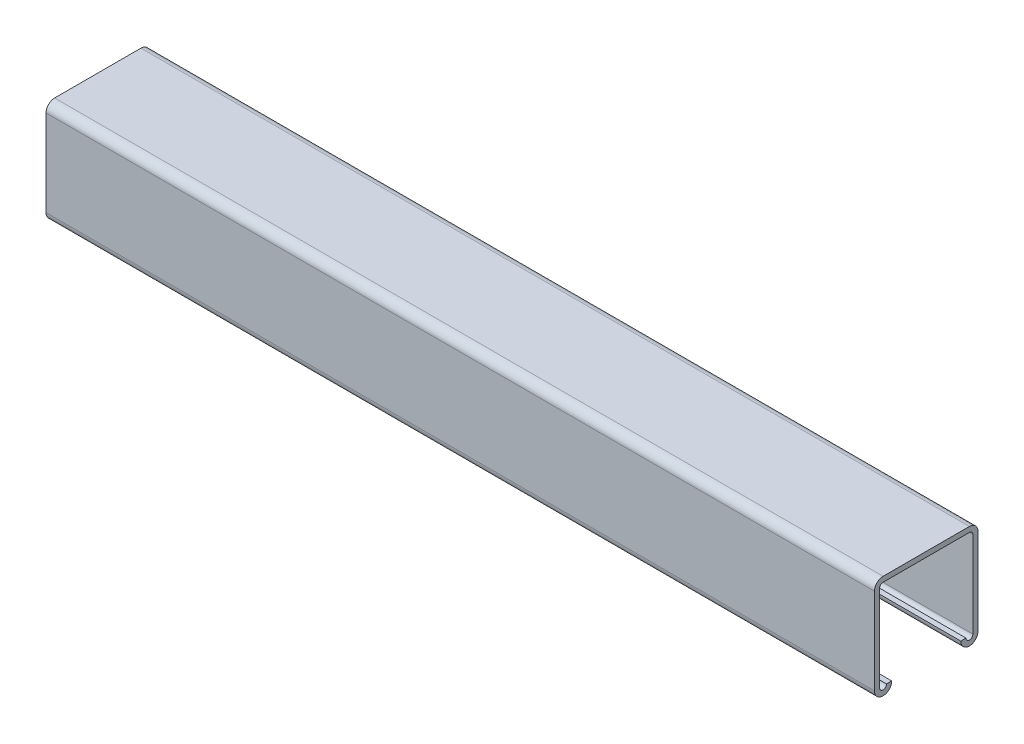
ISO-10303-21;
HEADER;
FILE_DESCRIPTION(('STEP AP214'),'2;1');
FILE_NAME('part.step','',(''),(''),'','','');
FILE_SCHEMA(('AUTOMOTIVE_DESIGN { 1 0 10303 214 1 1 1 1 }'));
ENDSEC;
DATA;
#1=APPLICATION_CONTEXT('core data for automotive mechanical design processes');
#2=APPLICATION_PROTOCOL_DEFINITION('international standard','automotive_design',2000,#1);
#3=PRODUCT_CONTEXT('',#1,'mechanical');
#4=PRODUCT('Part','Part','',(#3));
#5=PRODUCT_RELATED_PRODUCT_CATEGORY('part','',(#4));
#6=PRODUCT_DEFINITION_FORMATION('','',#4);
#7=PRODUCT_DEFINITION_CONTEXT('part definition',#1,'design');
#8=PRODUCT_DEFINITION('design','',#6,#7);
#9=PRODUCT_DEFINITION_SHAPE('','',#8);
#10=(LENGTH_UNIT() NAMED_UNIT(*) SI_UNIT(.MILLI.,.METRE.));
#11=(NAMED_UNIT(*) PLANE_ANGLE_UNIT() SI_UNIT($,.RADIAN.));
#12=(NAMED_UNIT(*) SI_UNIT($,.STERADIAN.) SOLID_ANGLE_UNIT());
#13=UNCERTAINTY_MEASURE_WITH_UNIT(LENGTH_MEASURE(1.E-05),#10,'distance_accuracy_value','');
#14=(GEOMETRIC_REPRESENTATION_CONTEXT(3) GLOBAL_UNCERTAINTY_ASSIGNED_CONTEXT((#13)) GLOBAL_UNIT_ASSIGNED_CONTEXT((#10,
#11,#12)) REPRESENTATION_CONTEXT('',''));
#15=CARTESIAN_POINT('',(0.,0.,0.));
#16=DIRECTION('',(0.,0.,1.));
#17=DIRECTION('',(1.,0.,0.));
#18=AXIS2_PLACEMENT_3D('',#15,#16,#17);
#19=CARTESIAN_POINT('',(304.8,-34.925,-15.875));
#20=DIRECTION('',(-1.,0.,0.));
#21=DIRECTION('',(0.,0.,1.));
#22=AXIS2_PLACEMENT_3D('',#19,#20,#21);
#23=CYLINDRICAL_SURFACE('',#22,1.27);
#24=CARTESIAN_POINT('',(0.,-34.925,-15.875));
#25=DIRECTION('',(1.,0.,0.));
#26=DIRECTION('',(0.,0.,1.));
#27=AXIS2_PLACEMENT_3D('',#24,#25,#26);
#28=CIRCLE('',#27,1.27);
#29=CARTESIAN_POINT('',(0.,-34.925,-17.145));
#30=VERTEX_POINT('',#29);
#31=CARTESIAN_POINT('',(0.,-34.925,-14.605));
#32=VERTEX_POINT('',#31);
#33=EDGE_CURVE('E151',#30,#32,#28,.F.);
#34=ORIENTED_EDGE('',*,*,#33,.T.);
#35=DIRECTION('',(-1.,0.,0.));
#36=VECTOR('',#35,1.);
#37=CARTESIAN_POINT('',(304.8,-34.925,-14.605));
#38=LINE('',#37,#36);
#39=CARTESIAN_POINT('',(304.8,-34.925,-14.605));
#40=VERTEX_POINT('',#39);
#41=EDGE_CURVE('E11',#40,#32,#38,.T.);
#42=ORIENTED_EDGE('',*,*,#41,.F.);
#43=CARTESIAN_POINT('',(304.8,-34.925,-15.875));
#44=DIRECTION('',(1.,0.,0.));
#45=DIRECTION('',(0.,0.,1.));
#46=AXIS2_PLACEMENT_3D('',#43,#44,#45);
#47=CIRCLE('',#46,1.27);
#48=CARTESIAN_POINT('',(304.8,-34.925,-17.145));
#49=VERTEX_POINT('',#48);
#50=EDGE_CURVE('E195',#49,#40,#47,.F.);
#51=ORIENTED_EDGE('',*,*,#50,.F.);
#52=DIRECTION('',(-1.,0.,0.));
#53=VECTOR('',#52,1.);
#54=CARTESIAN_POINT('',(304.8,-34.925,-17.145));
#55=LINE('',#54,#53);
#56=EDGE_CURVE('E152',#49,#30,#55,.T.);
#57=ORIENTED_EDGE('',*,*,#56,.T.);
#58=EDGE_LOOP('',(#34,#42,#51,#57));
#59=FACE_BOUND('',#58,.T.);
#60=ADVANCED_FACE('F29',(#59),#23,.F.);
#61=CARTESIAN_POINT('',(304.8,-34.925,-12.7));
#62=DIRECTION('',(0.,1.,0.));
#63=DIRECTION('',(0.,0.,1.));
#64=AXIS2_PLACEMENT_3D('',#61,#62,#63);
#65=PLANE('',#64);
#66=DIRECTION('',(0.,0.,-1.));
#67=VECTOR('',#66,1.);
#68=CARTESIAN_POINT('',(0.,-34.925,-12.7));
#69=LINE('',#68,#67);
#70=CARTESIAN_POINT('',(0.,-34.925,-12.7));
#71=VERTEX_POINT('',#70);
#72=EDGE_CURVE('E143',#71,#32,#69,.T.);
#73=ORIENTED_EDGE('',*,*,#72,.F.);
#74=DIRECTION('',(-1.,0.,0.));
#75=VECTOR('',#74,1.);
#76=CARTESIAN_POINT('',(304.8,-34.925,-12.7));
#77=LINE('',#76,#75);
#78=CARTESIAN_POINT('',(304.8,-34.925,-12.7));
#79=VERTEX_POINT('',#78);
#80=EDGE_CURVE('E36',#79,#71,#77,.T.);
#81=ORIENTED_EDGE('',*,*,#80,.F.);
#82=DIRECTION('',(0.,0.,-1.));
#83=VECTOR('',#82,1.);
#84=CARTESIAN_POINT('',(304.8,-34.925,-12.7));
#85=LINE('',#84,#83);
#86=EDGE_CURVE('E146',#79,#40,#85,.T.);
#87=ORIENTED_EDGE('',*,*,#86,.T.);
#88=ORIENTED_EDGE('',*,*,#41,.T.);
#89=EDGE_LOOP('',(#73,#81,#87,#88));
#90=FACE_BOUND('',#89,.T.);
#91=ADVANCED_FACE('F141',(#90),#65,.T.);
#92=CARTESIAN_POINT('',(304.8,-34.925,-15.875));
#93=DIRECTION('',(-1.,0.,0.));
#94=DIRECTION('',(0.,0.,1.));
#95=AXIS2_PLACEMENT_3D('',#92,#93,#94);
#96=CYLINDRICAL_SURFACE('',#95,3.175);
#97=CARTESIAN_POINT('',(0.,-34.925,-15.875));
#98=DIRECTION('',(-1.,0.,0.));
#99=DIRECTION('',(0.,0.,1.));
#100=AXIS2_PLACEMENT_3D('',#97,#98,#99);
#101=CIRCLE('',#100,3.175);
#102=CARTESIAN_POINT('',(0.,-34.925,-19.05));
#103=VERTEX_POINT('',#102);
#104=EDGE_CURVE('E159',#103,#71,#101,.T.);
#105=ORIENTED_EDGE('',*,*,#104,.F.);
#106=DIRECTION('',(-1.,0.,0.));
#107=VECTOR('',#106,1.);
#108=CARTESIAN_POINT('',(304.8,-34.925,-19.05));
#109=LINE('',#108,#107);
#110=CARTESIAN_POINT('',(304.8,-34.925,-19.05));
#111=VERTEX_POINT('',#110);
#112=EDGE_CURVE('E262',#111,#103,#109,.T.);
#113=ORIENTED_EDGE('',*,*,#112,.F.);
#114=CARTESIAN_POINT('',(304.8,-34.925,-15.875));
#115=DIRECTION('',(-1.,0.,0.));
#116=DIRECTION('',(0.,0.,1.));
#117=AXIS2_PLACEMENT_3D('',#114,#115,#116);
#118=CIRCLE('',#117,3.175);
#119=EDGE_CURVE('E198',#111,#79,#118,.T.);
#120=ORIENTED_EDGE('',*,*,#119,.T.);
#121=ORIENTED_EDGE('',*,*,#80,.T.);
#122=EDGE_LOOP('',(#105,#113,#120,#121));
#123=FACE_BOUND('',#122,.T.);
#124=ADVANCED_FACE('F264',(#123),#96,.T.);
#125=CARTESIAN_POINT('',(304.8,-3.175,-19.05));
#126=DIRECTION('',(0.,0.,-1.));
#127=DIRECTION('',(0.,1.,0.));
#128=AXIS2_PLACEMENT_3D('',#125,#126,#127);
#129=PLANE('',#128);
#130=DIRECTION('',(0.,-1.,0.));
#131=VECTOR('',#130,1.);
#132=CARTESIAN_POINT('',(0.,-3.175,-19.05));
#133=LINE('',#132,#131);
#134=CARTESIAN_POINT('',(0.,-3.175,-19.05));
#135=VERTEX_POINT('',#134);
#136=EDGE_CURVE('E161',#135,#103,#133,.T.);
#137=ORIENTED_EDGE('',*,*,#136,.F.);
#138=DIRECTION('',(-1.,0.,0.));
#139=VECTOR('',#138,1.);
#140=CARTESIAN_POINT('',(304.8,-3.175,-19.05));
#141=LINE('',#140,#139);
#142=CARTESIAN_POINT('',(304.8,-3.175,-19.05));
#143=VERTEX_POINT('',#142);
#144=EDGE_CURVE('E260',#143,#135,#141,.T.);
#145=ORIENTED_EDGE('',*,*,#144,.F.);
#146=DIRECTION('',(0.,-1.,0.));
#147=VECTOR('',#146,1.);
#148=CARTESIAN_POINT('',(304.8,-3.175,-19.05));
#149=LINE('',#148,#147);
#150=EDGE_CURVE('E201',#143,#111,#149,.T.);
#151=ORIENTED_EDGE('',*,*,#150,.T.);
#152=ORIENTED_EDGE('',*,*,#112,.T.);
#153=EDGE_LOOP('',(#137,#145,#151,#152));
#154=FACE_BOUND('',#153,.T.);
#155=ADVANCED_FACE('F271',(#154),#129,.T.);
#156=CARTESIAN_POINT('',(304.8,-3.175,-15.875));
#157=DIRECTION('',(-1.,0.,0.));
#158=DIRECTION('',(0.,0.,1.));
#159=AXIS2_PLACEMENT_3D('',#156,#157,#158);
#160=CYLINDRICAL_SURFACE('',#159,3.17499999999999);
#161=CARTESIAN_POINT('',(0.,-3.175,-15.875));
#162=DIRECTION('',(-1.,0.,0.));
#163=DIRECTION('',(0.,0.,1.));
#164=AXIS2_PLACEMENT_3D('',#161,#162,#163);
#165=CIRCLE('',#164,3.17499999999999);
#166=CARTESIAN_POINT('',(0.,0.,-15.875));
#167=VERTEX_POINT('',#166);
#168=EDGE_CURVE('E165',#167,#135,#165,.T.);
#169=ORIENTED_EDGE('',*,*,#168,.F.);
#170=DIRECTION('',(-1.,0.,0.));
#171=VECTOR('',#170,1.);
#172=CARTESIAN_POINT('',(304.8,0.,-15.875));
#173=LINE('',#172,#171);
#174=CARTESIAN_POINT('',(304.8,0.,-15.875));
#175=VERTEX_POINT('',#174);
#176=EDGE_CURVE('E258',#175,#167,#173,.T.);
#177=ORIENTED_EDGE('',*,*,#176,.F.);
#178=CARTESIAN_POINT('',(304.8,-3.175,-15.875));
#179=DIRECTION('',(-1.,0.,0.));
#180=DIRECTION('',(0.,0.,1.));
#181=AXIS2_PLACEMENT_3D('',#178,#179,#180);
#182=CIRCLE('',#181,3.17499999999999);
#183=EDGE_CURVE('E204',#175,#143,#182,.T.);
#184=ORIENTED_EDGE('',*,*,#183,.T.);
#185=ORIENTED_EDGE('',*,*,#144,.T.);
#186=EDGE_LOOP('',(#169,#177,#184,#185));
#187=FACE_BOUND('',#186,.T.);
#188=ADVANCED_FACE('F274',(#187),#160,.T.);
#189=CARTESIAN_POINT('',(304.8,0.,-15.875));
#190=DIRECTION('',(0.,1.,0.));
#191=DIRECTION('',(0.,0.,1.));
#192=AXIS2_PLACEMENT_3D('',#189,#190,#191);
#193=PLANE('',#192);
#194=DIRECTION('',(0.,0.,-1.));
#195=VECTOR('',#194,1.);
#196=CARTESIAN_POINT('',(0.,0.,-15.875));
#197=LINE('',#196,#195);
#198=CARTESIAN_POINT('',(0.,0.,15.875));
#199=VERTEX_POINT('',#198);
#200=EDGE_CURVE('E168',#199,#167,#197,.T.);
#201=ORIENTED_EDGE('',*,*,#200,.F.);
#202=DIRECTION('',(-1.,0.,0.));
#203=VECTOR('',#202,1.);
#204=CARTESIAN_POINT('',(304.8,0.,15.875));
#205=LINE('',#204,#203);
#206=CARTESIAN_POINT('',(304.8,0.,15.875));
#207=VERTEX_POINT('',#206);
#208=EDGE_CURVE('E256',#207,#199,#205,.T.);
#209=ORIENTED_EDGE('',*,*,#208,.F.);
#210=DIRECTION('',(0.,0.,-1.));
#211=VECTOR('',#210,1.);
#212=CARTESIAN_POINT('',(304.8,0.,-15.875));
#213=LINE('',#212,#211);
#214=EDGE_CURVE('E207',#207,#175,#213,.T.);
#215=ORIENTED_EDGE('',*,*,#214,.T.);
#216=ORIENTED_EDGE('',*,*,#176,.T.);
#217=EDGE_LOOP('',(#201,#209,#215,#216));
#218=FACE_BOUND('',#217,.T.);
#219=ADVANCED_FACE('F279',(#218),#193,.T.);
#220=CARTESIAN_POINT('',(304.8,-3.175,15.875));
#221=DIRECTION('',(-1.,0.,0.));
#222=DIRECTION('',(0.,0.,1.));
#223=AXIS2_PLACEMENT_3D('',#220,#221,#222);
#224=CYLINDRICAL_SURFACE('',#223,3.17499999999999);
#225=CARTESIAN_POINT('',(0.,-3.175,15.875));
#226=DIRECTION('',(-1.,0.,0.));
#227=DIRECTION('',(0.,0.,-1.));
#228=AXIS2_PLACEMENT_3D('',#225,#226,#227);
#229=CIRCLE('',#228,3.17499999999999);
#230=CARTESIAN_POINT('',(0.,-3.175,19.05));
#231=VERTEX_POINT('',#230);
#232=EDGE_CURVE('E171',#231,#199,#229,.T.);
#233=ORIENTED_EDGE('',*,*,#232,.F.);
#234=DIRECTION('',(-1.,0.,0.));
#235=VECTOR('',#234,1.);
#236=CARTESIAN_POINT('',(304.8,-3.175,19.05));
#237=LINE('',#236,#235);
#238=CARTESIAN_POINT('',(304.8,-3.175,19.05));
#239=VERTEX_POINT('',#238);
#240=EDGE_CURVE('E254',#239,#231,#237,.T.);
#241=ORIENTED_EDGE('',*,*,#240,.F.);
#242=CARTESIAN_POINT('',(304.8,-3.175,15.875));
#243=DIRECTION('',(-1.,0.,0.));
#244=DIRECTION('',(0.,0.,-1.));
#245=AXIS2_PLACEMENT_3D('',#242,#243,#244);
#246=CIRCLE('',#245,3.17499999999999);
#247=EDGE_CURVE('E210',#239,#207,#246,.T.);
#248=ORIENTED_EDGE('',*,*,#247,.T.);
#249=ORIENTED_EDGE('',*,*,#208,.T.);
#250=EDGE_LOOP('',(#233,#241,#248,#249));
#251=FACE_BOUND('',#250,.T.);
#252=ADVANCED_FACE('F282',(#251),#224,.T.);
#253=CARTESIAN_POINT('',(304.8,-3.175,19.05));
#254=DIRECTION('',(0.,0.,1.));
#255=DIRECTION('',(0.,-1.,0.));
#256=AXIS2_PLACEMENT_3D('',#253,#254,#255);
#257=PLANE('',#256);
#258=DIRECTION('',(0.,1.,0.));
#259=VECTOR('',#258,1.);
#260=CARTESIAN_POINT('',(0.,-3.175,19.05));
#261=LINE('',#260,#259);
#262=CARTESIAN_POINT('',(0.,-34.925,19.05));
#263=VERTEX_POINT('',#262);
#264=EDGE_CURVE('E174',#263,#231,#261,.T.);
#265=ORIENTED_EDGE('',*,*,#264,.F.);
#266=DIRECTION('',(-1.,0.,0.));
#267=VECTOR('',#266,1.);
#268=CARTESIAN_POINT('',(304.8,-34.925,19.05));
#269=LINE('',#268,#267);
#270=CARTESIAN_POINT('',(304.8,-34.925,19.05));
#271=VERTEX_POINT('',#270);
#272=EDGE_CURVE('E252',#271,#263,#269,.T.);
#273=ORIENTED_EDGE('',*,*,#272,.F.);
#274=DIRECTION('',(0.,1.,0.));
#275=VECTOR('',#274,1.);
#276=CARTESIAN_POINT('',(304.8,-3.175,19.05));
#277=LINE('',#276,#275);
#278=EDGE_CURVE('E213',#271,#239,#277,.T.);
#279=ORIENTED_EDGE('',*,*,#278,.T.);
#280=ORIENTED_EDGE('',*,*,#240,.T.);
#281=EDGE_LOOP('',(#265,#273,#279,#280));
#282=FACE_BOUND('',#281,.T.);
#283=ADVANCED_FACE('F287',(#282),#257,.T.);
#284=CARTESIAN_POINT('',(304.8,-34.925,15.875));
#285=DIRECTION('',(-1.,0.,0.));
#286=DIRECTION('',(0.,0.,1.));
#287=AXIS2_PLACEMENT_3D('',#284,#285,#286);
#288=CYLINDRICAL_SURFACE('',#287,3.175);
#289=CARTESIAN_POINT('',(0.,-34.925,15.875));
#290=DIRECTION('',(-1.,0.,0.));
#291=DIRECTION('',(0.,0.,-1.));
#292=AXIS2_PLACEMENT_3D('',#289,#290,#291);
#293=CIRCLE('',#292,3.175);
#294=CARTESIAN_POINT('',(0.,-34.925,12.7));
#295=VERTEX_POINT('',#294);
#296=EDGE_CURVE('E177',#295,#263,#293,.T.);
#297=ORIENTED_EDGE('',*,*,#296,.F.);
#298=DIRECTION('',(-1.,0.,0.));
#299=VECTOR('',#298,1.);
#300=CARTESIAN_POINT('',(304.8,-34.925,12.7));
#301=LINE('',#300,#299);
#302=CARTESIAN_POINT('',(304.8,-34.925,12.7));
#303=VERTEX_POINT('',#302);
#304=EDGE_CURVE('E250',#303,#295,#301,.T.);
#305=ORIENTED_EDGE('',*,*,#304,.F.);
#306=CARTESIAN_POINT('',(304.8,-34.925,15.875));
#307=DIRECTION('',(-1.,0.,0.));
#308=DIRECTION('',(0.,0.,-1.));
#309=AXIS2_PLACEMENT_3D('',#306,#307,#308);
#310=CIRCLE('',#309,3.175);
#311=EDGE_CURVE('E216',#303,#271,#310,.T.);
#312=ORIENTED_EDGE('',*,*,#311,.T.);
#313=ORIENTED_EDGE('',*,*,#272,.T.);
#314=EDGE_LOOP('',(#297,#305,#312,#313));
#315=FACE_BOUND('',#314,.T.);
#316=ADVANCED_FACE('F290',(#315),#288,.T.);
#317=CARTESIAN_POINT('',(304.8,-34.925,14.605));
#318=DIRECTION('',(0.,1.,0.));
#319=DIRECTION('',(0.,0.,1.));
#320=AXIS2_PLACEMENT_3D('',#317,#318,#319);
#321=PLANE('',#320);
#322=DIRECTION('',(0.,0.,-1.));
#323=VECTOR('',#322,1.);
#324=CARTESIAN_POINT('',(0.,-34.925,14.605));
#325=LINE('',#324,#323);
#326=CARTESIAN_POINT('',(0.,-34.925,14.605));
#327=VERTEX_POINT('',#326);
#328=EDGE_CURVE('E180',#327,#295,#325,.T.);
#329=ORIENTED_EDGE('',*,*,#328,.F.);
#330=DIRECTION('',(-1.,0.,0.));
#331=VECTOR('',#330,1.);
#332=CARTESIAN_POINT('',(304.8,-34.925,14.605));
#333=LINE('',#332,#331);
#334=CARTESIAN_POINT('',(304.8,-34.925,14.605));
#335=VERTEX_POINT('',#334);
#336=EDGE_CURVE('E248',#335,#327,#333,.T.);
#337=ORIENTED_EDGE('',*,*,#336,.F.);
#338=DIRECTION('',(0.,0.,-1.));
#339=VECTOR('',#338,1.);
#340=CARTESIAN_POINT('',(304.8,-34.925,14.605));
#341=LINE('',#340,#339);
#342=EDGE_CURVE('E219',#335,#303,#341,.T.);
#343=ORIENTED_EDGE('',*,*,#342,.T.);
#344=ORIENTED_EDGE('',*,*,#304,.T.);
#345=EDGE_LOOP('',(#329,#337,#343,#344));
#346=FACE_BOUND('',#345,.T.);
#347=ADVANCED_FACE('F294',(#346),#321,.T.);
#348=CARTESIAN_POINT('',(304.8,-34.925,15.875));
#349=DIRECTION('',(-1.,0.,0.));
#350=DIRECTION('',(0.,0.,1.));
#351=AXIS2_PLACEMENT_3D('',#348,#349,#350);
#352=CYLINDRICAL_SURFACE('',#351,1.27);
#353=CARTESIAN_POINT('',(0.,-34.925,15.875));
#354=DIRECTION('',(1.,0.,0.));
#355=DIRECTION('',(0.,0.,1.));
#356=AXIS2_PLACEMENT_3D('',#353,#354,#355);
#357=CIRCLE('',#356,1.27);
#358=CARTESIAN_POINT('',(0.,-34.925,17.145));
#359=VERTEX_POINT('',#358);
#360=EDGE_CURVE('E183',#327,#359,#357,.F.);
#361=ORIENTED_EDGE('',*,*,#360,.T.);
#362=DIRECTION('',(-1.,0.,0.));
#363=VECTOR('',#362,1.);
#364=CARTESIAN_POINT('',(304.8,-34.925,17.145));
#365=LINE('',#364,#363);
#366=CARTESIAN_POINT('',(304.8,-34.925,17.145));
#367=VERTEX_POINT('',#366);
#368=EDGE_CURVE('E245',#367,#359,#365,.T.);
#369=ORIENTED_EDGE('',*,*,#368,.F.);
#370=CARTESIAN_POINT('',(304.8,-34.925,15.875));
#371=DIRECTION('',(1.,0.,0.));
#372=DIRECTION('',(0.,0.,1.));
#373=AXIS2_PLACEMENT_3D('',#370,#371,#372);
#374=CIRCLE('',#373,1.27);
#375=EDGE_CURVE('E222',#335,#367,#374,.F.);
#376=ORIENTED_EDGE('',*,*,#375,.F.);
#377=ORIENTED_EDGE('',*,*,#336,.T.);
#378=EDGE_LOOP('',(#361,#369,#376,#377));
#379=FACE_BOUND('',#378,.T.);
#380=ADVANCED_FACE('F299',(#379),#352,.F.);
#381=CARTESIAN_POINT('',(304.8,-3.175,17.145));
#382=DIRECTION('',(0.,0.,1.));
#383=DIRECTION('',(0.,-1.,0.));
#384=AXIS2_PLACEMENT_3D('',#381,#382,#383);
#385=PLANE('',#384);
#386=DIRECTION('',(0.,1.,0.));
#387=VECTOR('',#386,1.);
#388=CARTESIAN_POINT('',(0.,-3.175,17.145));
#389=LINE('',#388,#387);
#390=CARTESIAN_POINT('',(0.,-3.175,17.145));
#391=VERTEX_POINT('',#390);
#392=EDGE_CURVE('E185',#359,#391,#389,.T.);
#393=ORIENTED_EDGE('',*,*,#392,.T.);
#394=DIRECTION('',(-1.,0.,0.));
#395=VECTOR('',#394,1.);
#396=CARTESIAN_POINT('',(304.8,-3.175,17.145));
#397=LINE('',#396,#395);
#398=CARTESIAN_POINT('',(304.8,-3.175,17.145));
#399=VERTEX_POINT('',#398);
#400=EDGE_CURVE('E242',#399,#391,#397,.T.);
#401=ORIENTED_EDGE('',*,*,#400,.F.);
#402=DIRECTION('',(0.,1.,0.));
#403=VECTOR('',#402,1.);
#404=CARTESIAN_POINT('',(304.8,-3.175,17.145));
#405=LINE('',#404,#403);
#406=EDGE_CURVE('E224',#367,#399,#405,.T.);
#407=ORIENTED_EDGE('',*,*,#406,.F.);
#408=ORIENTED_EDGE('',*,*,#368,.T.);
#409=EDGE_LOOP('',(#393,#401,#407,#408));
#410=FACE_BOUND('',#409,.T.);
#411=ADVANCED_FACE('F305',(#410),#385,.F.);
#412=CARTESIAN_POINT('',(304.8,-3.175,15.875));
#413=DIRECTION('',(-1.,0.,0.));
#414=DIRECTION('',(0.,0.,1.));
#415=AXIS2_PLACEMENT_3D('',#412,#413,#414);
#416=CYLINDRICAL_SURFACE('',#415,1.26999999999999);
#417=CARTESIAN_POINT('',(0.,-3.175,15.875));
#418=DIRECTION('',(1.,0.,0.));
#419=DIRECTION('',(0.,0.,1.));
#420=AXIS2_PLACEMENT_3D('',#417,#418,#419);
#421=CIRCLE('',#420,1.26999999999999);
#422=CARTESIAN_POINT('',(0.,-1.905,15.875));
#423=VERTEX_POINT('',#422);
#424=EDGE_CURVE('E187',#391,#423,#421,.F.);
#425=ORIENTED_EDGE('',*,*,#424,.T.);
#426=DIRECTION('',(-1.,0.,0.));
#427=VECTOR('',#426,1.);
#428=CARTESIAN_POINT('',(304.8,-1.905,15.875));
#429=LINE('',#428,#427);
#430=CARTESIAN_POINT('',(304.8,-1.905,15.875));
#431=VERTEX_POINT('',#430);
#432=EDGE_CURVE('E239',#431,#423,#429,.T.);
#433=ORIENTED_EDGE('',*,*,#432,.F.);
#434=CARTESIAN_POINT('',(304.8,-3.175,15.875));
#435=DIRECTION('',(1.,0.,0.));
#436=DIRECTION('',(0.,0.,1.));
#437=AXIS2_PLACEMENT_3D('',#434,#435,#436);
#438=CIRCLE('',#437,1.26999999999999);
#439=EDGE_CURVE('E226',#399,#431,#438,.F.);
#440=ORIENTED_EDGE('',*,*,#439,.F.);
#441=ORIENTED_EDGE('',*,*,#400,.T.);
#442=EDGE_LOOP('',(#425,#433,#440,#441));
#443=FACE_BOUND('',#442,.T.);
#444=ADVANCED_FACE('F309',(#443),#416,.F.);
#445=CARTESIAN_POINT('',(304.8,-1.905,-15.875));
#446=DIRECTION('',(0.,1.,0.));
#447=DIRECTION('',(0.,0.,1.));
#448=AXIS2_PLACEMENT_3D('',#445,#446,#447);
#449=PLANE('',#448);
#450=DIRECTION('',(0.,0.,1.));
#451=VECTOR('',#450,1.);
#452=CARTESIAN_POINT('',(0.,-1.905,-15.875));
#453=LINE('',#452,#451);
#454=CARTESIAN_POINT('',(0.,-1.905,-15.875));
#455=VERTEX_POINT('',#454);
#456=EDGE_CURVE('E189',#423,#455,#453,.F.);
#457=ORIENTED_EDGE('',*,*,#456,.T.);
#458=DIRECTION('',(-1.,0.,0.));
#459=VECTOR('',#458,1.);
#460=CARTESIAN_POINT('',(304.8,-1.905,-15.875));
#461=LINE('',#460,#459);
#462=CARTESIAN_POINT('',(304.8,-1.905,-15.875));
#463=VERTEX_POINT('',#462);
#464=EDGE_CURVE('E236',#463,#455,#461,.T.);
#465=ORIENTED_EDGE('',*,*,#464,.F.);
#466=DIRECTION('',(0.,0.,1.));
#467=VECTOR('',#466,1.);
#468=CARTESIAN_POINT('',(304.8,-1.905,-15.875));
#469=LINE('',#468,#467);
#470=EDGE_CURVE('E228',#431,#463,#469,.F.);
#471=ORIENTED_EDGE('',*,*,#470,.F.);
#472=ORIENTED_EDGE('',*,*,#432,.T.);
#473=EDGE_LOOP('',(#457,#465,#471,#472));
#474=FACE_BOUND('',#473,.T.);
#475=ADVANCED_FACE('F314',(#474),#449,.F.);
#476=CARTESIAN_POINT('',(304.8,-3.175,-15.875));
#477=DIRECTION('',(-1.,0.,0.));
#478=DIRECTION('',(0.,0.,1.));
#479=AXIS2_PLACEMENT_3D('',#476,#477,#478);
#480=CYLINDRICAL_SURFACE('',#479,1.26999999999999);
#481=CARTESIAN_POINT('',(0.,-3.175,-15.875));
#482=DIRECTION('',(1.,0.,0.));
#483=DIRECTION('',(0.,0.,1.));
#484=AXIS2_PLACEMENT_3D('',#481,#482,#483);
#485=CIRCLE('',#484,1.26999999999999);
#486=CARTESIAN_POINT('',(0.,-3.175,-17.145));
#487=VERTEX_POINT('',#486);
#488=EDGE_CURVE('E191',#455,#487,#485,.F.);
#489=ORIENTED_EDGE('',*,*,#488,.T.);
#490=DIRECTION('',(-1.,0.,0.));
#491=VECTOR('',#490,1.);
#492=CARTESIAN_POINT('',(304.8,-3.175,-17.145));
#493=LINE('',#492,#491);
#494=CARTESIAN_POINT('',(304.8,-3.175,-17.145));
#495=VERTEX_POINT('',#494);
#496=EDGE_CURVE('E233',#495,#487,#493,.T.);
#497=ORIENTED_EDGE('',*,*,#496,.F.);
#498=CARTESIAN_POINT('',(304.8,-3.175,-15.875));
#499=DIRECTION('',(1.,0.,0.));
#500=DIRECTION('',(0.,0.,1.));
#501=AXIS2_PLACEMENT_3D('',#498,#499,#500);
#502=CIRCLE('',#501,1.26999999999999);
#503=EDGE_CURVE('E48',#463,#495,#502,.F.);
#504=ORIENTED_EDGE('',*,*,#503,.F.);
#505=ORIENTED_EDGE('',*,*,#464,.T.);
#506=EDGE_LOOP('',(#489,#497,#504,#505));
#507=FACE_BOUND('',#506,.T.);
#508=ADVANCED_FACE('F317',(#507),#480,.F.);
#509=CARTESIAN_POINT('',(304.8,-3.175,-17.145));
#510=DIRECTION('',(0.,0.,-1.));
#511=DIRECTION('',(0.,1.,0.));
#512=AXIS2_PLACEMENT_3D('',#509,#510,#511);
#513=PLANE('',#512);
#514=DIRECTION('',(0.,-1.,0.));
#515=VECTOR('',#514,1.);
#516=CARTESIAN_POINT('',(0.,-3.175,-17.145));
#517=LINE('',#516,#515);
#518=EDGE_CURVE('E193',#487,#30,#517,.T.);
#519=ORIENTED_EDGE('',*,*,#518,.T.);
#520=ORIENTED_EDGE('',*,*,#56,.F.);
#521=DIRECTION('',(0.,-1.,0.));
#522=VECTOR('',#521,1.);
#523=CARTESIAN_POINT('',(304.8,-3.175,-17.145));
#524=LINE('',#523,#522);
#525=EDGE_CURVE('E43',#495,#49,#524,.T.);
#526=ORIENTED_EDGE('',*,*,#525,.F.);
#527=ORIENTED_EDGE('',*,*,#496,.T.);
#528=EDGE_LOOP('',(#519,#520,#526,#527));
#529=FACE_BOUND('',#528,.T.);
#530=ADVANCED_FACE('F319',(#529),#513,.F.);
#531=CARTESIAN_POINT('',(304.8,-34.925,-15.875));
#532=DIRECTION('',(1.,0.,0.));
#533=DIRECTION('',(0.,0.,-1.));
#534=AXIS2_PLACEMENT_3D('',#531,#532,#533);
#535=PLANE('',#534);
#536=ORIENTED_EDGE('',*,*,#50,.T.);
#537=ORIENTED_EDGE('',*,*,#86,.F.);
#538=ORIENTED_EDGE('',*,*,#119,.F.);
#539=ORIENTED_EDGE('',*,*,#150,.F.);
#540=ORIENTED_EDGE('',*,*,#183,.F.);
#541=ORIENTED_EDGE('',*,*,#214,.F.);
#542=ORIENTED_EDGE('',*,*,#247,.F.);
#543=ORIENTED_EDGE('',*,*,#278,.F.);
#544=ORIENTED_EDGE('',*,*,#311,.F.);
#545=ORIENTED_EDGE('',*,*,#342,.F.);
#546=ORIENTED_EDGE('',*,*,#375,.T.);
#547=ORIENTED_EDGE('',*,*,#406,.T.);
#548=ORIENTED_EDGE('',*,*,#439,.T.);
#549=ORIENTED_EDGE('',*,*,#470,.T.);
#550=ORIENTED_EDGE('',*,*,#503,.T.);
#551=ORIENTED_EDGE('',*,*,#525,.T.);
#552=EDGE_LOOP('',(#536,#537,#538,#539,#540,#541,#542,#543,#544,#545,#546,#547,#548,#549,#550,#551));
#553=FACE_BOUND('',#552,.T.);
#554=ADVANCED_FACE('F266',(#553),#535,.T.);
#555=CARTESIAN_POINT('',(0.,-34.925,-15.875));
#556=DIRECTION('',(1.,0.,0.));
#557=DIRECTION('',(0.,0.,-1.));
#558=AXIS2_PLACEMENT_3D('',#555,#556,#557);
#559=PLANE('',#558);
#560=ORIENTED_EDGE('',*,*,#33,.F.);
#561=ORIENTED_EDGE('',*,*,#518,.F.);
#562=ORIENTED_EDGE('',*,*,#488,.F.);
#563=ORIENTED_EDGE('',*,*,#456,.F.);
#564=ORIENTED_EDGE('',*,*,#424,.F.);
#565=ORIENTED_EDGE('',*,*,#392,.F.);
#566=ORIENTED_EDGE('',*,*,#360,.F.);
#567=ORIENTED_EDGE('',*,*,#328,.T.);
#568=ORIENTED_EDGE('',*,*,#296,.T.);
#569=ORIENTED_EDGE('',*,*,#264,.T.);
#570=ORIENTED_EDGE('',*,*,#232,.T.);
#571=ORIENTED_EDGE('',*,*,#200,.T.);
#572=ORIENTED_EDGE('',*,*,#168,.T.);
#573=ORIENTED_EDGE('',*,*,#136,.T.);
#574=ORIENTED_EDGE('',*,*,#104,.T.);
#575=ORIENTED_EDGE('',*,*,#72,.T.);
#576=EDGE_LOOP('',(#560,#561,#562,#563,#564,#565,#566,#567,#568,#569,#570,#571,#572,#573,#574,#575));
#577=FACE_BOUND('',#576,.T.);
#578=ADVANCED_FACE('F156',(#577),#559,.F.);
#579=CLOSED_SHELL('',(#60,#91,#124,#155,#188,#219,#252,#283,#316,#347,#380,#411,#444,#475,#508,
#530,#554,#578));
#580=MANIFOLD_SOLID_BREP('B2',#579);
#581=ADVANCED_BREP_SHAPE_REPRESENTATION('',(#18,#580),#14);
#582=SHAPE_DEFINITION_REPRESENTATION(#9,#581);
ENDSEC;
END-ISO-10303-21;
